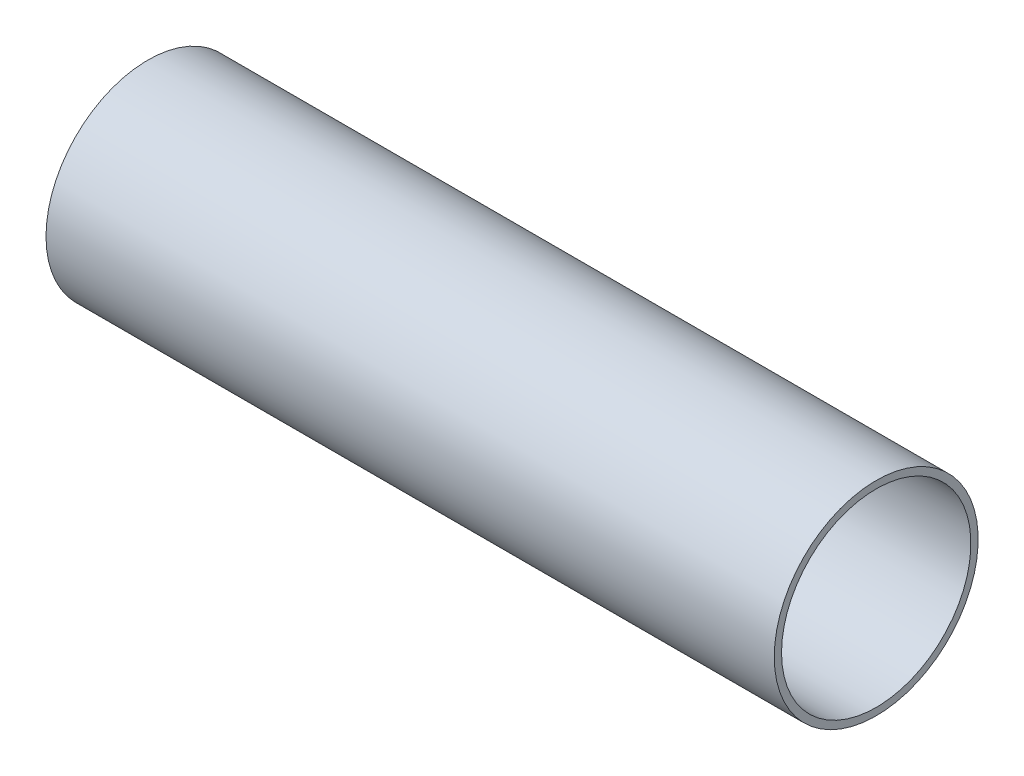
from build123d import *

# Parameters (mm, degrees)
ESQUISSE1_W = 100
ESQUISSE1_H = 1


with BuildPart() as part:
    # Esquisse1 → Base-R_volution (revolve)
    with BuildSketch(Plane.XY, mode=Mode.PRIVATE) as base_r_volution_sk:
        with Locations((50, 13.5)):
            Rectangle(ESQUISSE1_W, ESQUISSE1_H)
    revolve(base_r_volution_sk.sketch.rotate(Axis((0, 0, 0), (1, 0, 0)), 90), axis=Axis((0, 0, 0), (1, 0, 0)))


solid = part.part
